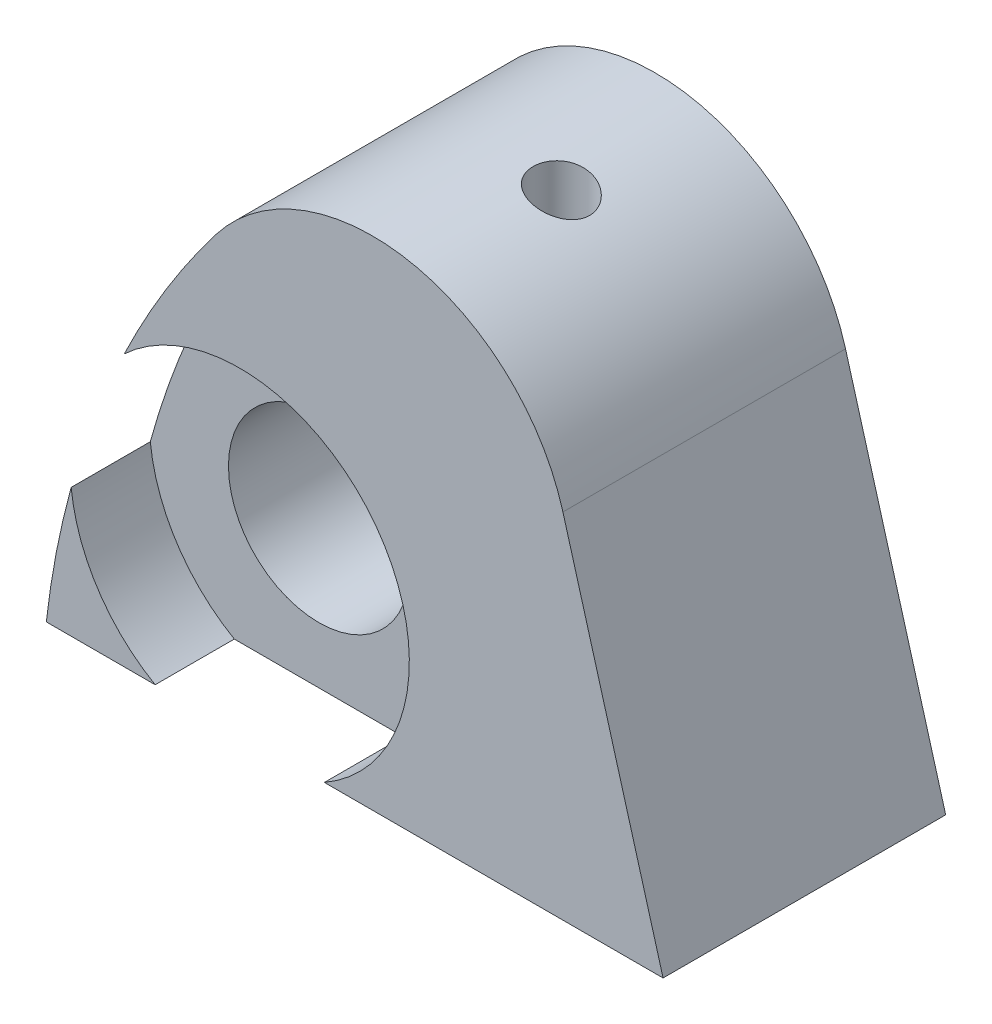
ISO-10303-21;
HEADER;
FILE_DESCRIPTION(('STEP AP214'),'2;1');
FILE_NAME('part.step','',(''),(''),'','','');
FILE_SCHEMA(('AUTOMOTIVE_DESIGN { 1 0 10303 214 1 1 1 1 }'));
ENDSEC;
DATA;
#1=APPLICATION_CONTEXT('core data for automotive mechanical design processes');
#2=APPLICATION_PROTOCOL_DEFINITION('international standard','automotive_design',2000,#1);
#3=PRODUCT_CONTEXT('',#1,'mechanical');
#4=PRODUCT('Part','Part','',(#3));
#5=PRODUCT_RELATED_PRODUCT_CATEGORY('part','',(#4));
#6=PRODUCT_DEFINITION_FORMATION('','',#4);
#7=PRODUCT_DEFINITION_CONTEXT('part definition',#1,'design');
#8=PRODUCT_DEFINITION('design','',#6,#7);
#9=PRODUCT_DEFINITION_SHAPE('','',#8);
#10=(LENGTH_UNIT() NAMED_UNIT(*) SI_UNIT(.MILLI.,.METRE.));
#11=(NAMED_UNIT(*) PLANE_ANGLE_UNIT() SI_UNIT($,.RADIAN.));
#12=(NAMED_UNIT(*) SI_UNIT($,.STERADIAN.) SOLID_ANGLE_UNIT());
#13=UNCERTAINTY_MEASURE_WITH_UNIT(LENGTH_MEASURE(1.E-05),#10,'distance_accuracy_value','');
#14=(GEOMETRIC_REPRESENTATION_CONTEXT(3) GLOBAL_UNCERTAINTY_ASSIGNED_CONTEXT((#13)) GLOBAL_UNIT_ASSIGNED_CONTEXT((#10,
#11,#12)) REPRESENTATION_CONTEXT('',''));
#15=CARTESIAN_POINT('',(0.,0.,0.));
#16=DIRECTION('',(0.,0.,1.));
#17=DIRECTION('',(1.,0.,0.));
#18=AXIS2_PLACEMENT_3D('',#15,#16,#17);
#19=CARTESIAN_POINT('',(0.839536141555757,3.5,2.5));
#20=DIRECTION('',(0.,-1.,0.));
#21=DIRECTION('',(1.,0.,0.));
#22=AXIS2_PLACEMENT_3D('',#19,#20,#21);
#23=CYLINDRICAL_SURFACE('',#22,0.5);
#24=CARTESIAN_POINT('',(1.33953614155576,3.23351866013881,2.5));
#25=CARTESIAN_POINT('',(1.33953481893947,3.2335194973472,2.52668078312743));
#26=CARTESIAN_POINT('',(1.33739077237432,3.23440999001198,2.55337834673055));
#27=CARTESIAN_POINT('',(1.32889966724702,3.23790762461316,2.60599641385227));
#28=CARTESIAN_POINT('',(1.32254813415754,3.24051659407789,2.63191605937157));
#29=CARTESIAN_POINT('',(1.30591617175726,3.24725462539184,2.68217754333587));
#30=CARTESIAN_POINT('',(1.29564519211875,3.251380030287,2.70652301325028));
#31=CARTESIAN_POINT('',(1.2715395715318,3.26088243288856,2.75310316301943));
#32=CARTESIAN_POINT('',(1.25770492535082,3.26625943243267,2.77533783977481));
#33=CARTESIAN_POINT('',(1.22629237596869,3.27818536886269,2.81803955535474));
#34=CARTESIAN_POINT('',(1.20858991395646,3.2847717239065,2.83840434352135));
#35=CARTESIAN_POINT('',(1.17028728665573,3.29861215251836,2.87592966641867));
#36=CARTESIAN_POINT('',(1.1496862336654,3.30586643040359,2.89308921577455));
#37=CARTESIAN_POINT('',(1.10465540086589,3.32119520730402,2.92487668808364));
#38=CARTESIAN_POINT('',(1.08006285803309,3.32929226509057,2.93926361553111));
#39=CARTESIAN_POINT('',(1.02879486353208,3.34549006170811,2.96366743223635));
#40=CARTESIAN_POINT('',(1.00211897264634,3.35359080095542,2.97368339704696));
#41=CARTESIAN_POINT('',(0.946588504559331,3.36969260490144,2.98927947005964));
#42=CARTESIAN_POINT('',(0.917693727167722,3.37768443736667,2.99472670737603));
#43=CARTESIAN_POINT('',(0.859227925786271,3.39302818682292,3.00047452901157));
#44=CARTESIAN_POINT('',(0.829656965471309,3.40038016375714,3.0007755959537));
#45=CARTESIAN_POINT('',(0.771246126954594,3.41409777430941,2.99616465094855));
#46=CARTESIAN_POINT('',(0.742402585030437,3.42047859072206,2.99134501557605));
#47=CARTESIAN_POINT('',(0.685815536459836,3.43227217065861,2.97667987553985));
#48=CARTESIAN_POINT('',(0.658071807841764,3.43768513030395,2.96683539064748));
#49=CARTESIAN_POINT('',(0.605517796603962,3.44732337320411,2.94276625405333));
#50=CARTESIAN_POINT('',(0.58063943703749,3.45158310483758,2.92870391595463));
#51=CARTESIAN_POINT('',(0.533548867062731,3.45917549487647,2.89646642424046));
#52=CARTESIAN_POINT('',(0.511336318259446,3.46250827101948,2.87829179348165));
#53=CARTESIAN_POINT('',(0.470751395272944,3.46825675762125,2.83879460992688));
#54=CARTESIAN_POINT('',(0.452304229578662,3.47069131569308,2.81755157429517));
#55=CARTESIAN_POINT('',(0.419204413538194,3.47484485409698,2.77222886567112));
#56=CARTESIAN_POINT('',(0.404551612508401,3.47656386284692,2.74814930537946));
#57=CARTESIAN_POINT('',(0.379564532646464,3.4793804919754,2.69800486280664));
#58=CARTESIAN_POINT('',(0.369203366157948,3.48048199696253,2.67195358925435));
#59=CARTESIAN_POINT('',(0.352971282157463,3.48216575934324,2.61847181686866));
#60=CARTESIAN_POINT('',(0.347100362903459,3.48274801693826,2.59104131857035));
#61=CARTESIAN_POINT('',(0.340019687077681,3.48344649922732,2.5355713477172));
#62=CARTESIAN_POINT('',(0.338811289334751,3.48356258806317,2.5075317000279));
#63=CARTESIAN_POINT('',(0.341094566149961,3.48333973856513,2.4516461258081));
#64=CARTESIAN_POINT('',(0.344586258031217,3.48300079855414,2.42380019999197));
#65=CARTESIAN_POINT('',(0.356170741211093,3.48183513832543,2.36907856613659));
#66=CARTESIAN_POINT('',(0.364265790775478,3.48100817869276,2.34220334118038));
#67=CARTESIAN_POINT('',(0.384820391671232,3.4787956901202,2.29020197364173));
#68=CARTESIAN_POINT('',(0.397279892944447,3.47741016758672,2.26507581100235));
#69=CARTESIAN_POINT('',(0.426182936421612,3.47398602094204,2.21730225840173));
#70=CARTESIAN_POINT('',(0.442623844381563,3.47194782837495,2.19465324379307));
#71=CARTESIAN_POINT('',(0.478998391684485,3.46711640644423,2.15245363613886));
#72=CARTESIAN_POINT('',(0.498931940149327,3.46432319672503,2.13290296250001));
#73=CARTESIAN_POINT('',(0.54168986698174,3.45789510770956,2.09743413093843));
#74=CARTESIAN_POINT('',(0.564514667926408,3.45426010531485,2.08151650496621));
#75=CARTESIAN_POINT('',(0.612361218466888,3.44609953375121,2.05372990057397));
#76=CARTESIAN_POINT('',(0.637382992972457,3.441573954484,2.04186096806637));
#77=CARTESIAN_POINT('',(0.68909172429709,3.43159597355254,2.02236394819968));
#78=CARTESIAN_POINT('',(0.715790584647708,3.42613632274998,2.01477119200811));
#79=CARTESIAN_POINT('',(0.76989666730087,3.41438510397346,2.00410586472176));
#80=CARTESIAN_POINT('',(0.797303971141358,3.40809343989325,2.00103381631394));
#81=CARTESIAN_POINT('',(0.852740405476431,3.39465262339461,1.99938736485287));
#82=CARTESIAN_POINT('',(0.880768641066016,3.3874864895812,2.00092288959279));
#83=CARTESIAN_POINT('',(0.936042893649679,3.37263154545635,2.00860858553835));
#84=CARTESIAN_POINT('',(0.963288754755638,3.36494263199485,2.01475966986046));
#85=CARTESIAN_POINT('',(1.01721981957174,3.34904177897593,2.03175354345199));
#86=CARTESIAN_POINT('',(1.04385440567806,3.3408209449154,2.04274884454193));
#87=CARTESIAN_POINT('',(1.09486863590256,3.32445202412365,2.06915139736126));
#88=CARTESIAN_POINT('',(1.11924788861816,3.31630395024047,2.0845594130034));
#89=CARTESIAN_POINT('',(1.16547483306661,3.30034491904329,2.11970962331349));
#90=CARTESIAN_POINT('',(1.18727438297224,3.29254169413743,2.13951883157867));
#91=CARTESIAN_POINT('',(1.22720378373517,3.27786888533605,2.18285429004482));
#92=CARTESIAN_POINT('',(1.24533332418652,3.27099938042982,2.20638085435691));
#93=CARTESIAN_POINT('',(1.27676926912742,3.25885503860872,2.25575230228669));
#94=CARTESIAN_POINT('',(1.29020890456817,3.25353700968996,2.28150154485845));
#95=CARTESIAN_POINT('',(1.31247665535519,3.24461871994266,2.33517284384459));
#96=CARTESIAN_POINT('',(1.32131275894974,3.24101548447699,2.36309103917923));
#97=CARTESIAN_POINT('',(1.33158932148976,3.23680194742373,2.40936421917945));
#98=CARTESIAN_POINT('',(1.33456326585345,3.23557498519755,2.42733738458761));
#99=CARTESIAN_POINT('',(1.33853706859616,3.23393307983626,2.46353776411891));
#100=CARTESIAN_POINT('',(1.33953704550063,3.233518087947,2.48176496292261));
#101=CARTESIAN_POINT('',(1.33953614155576,3.23351866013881,2.5));
#102=B_SPLINE_CURVE_WITH_KNOTS('',3,(#24,#25,#26,#27,#28,#29,#30,#31,#32,#33,#34,#35,#36,#37,
#38,#39,#40,#41,#42,#43,#44,#45,#46,#47,#48,#49,#50,#51,#52,#53,#54,#55,#56,#57,#58,#59,#60,#61,
#62,#63,#64,#65,#66,#67,#68,#69,#70,#71,#72,#73,#74,#75,#76,#77,#78,#79,#80,#81,#82,#83,#84,#85,
#86,#87,#88,#89,#90,#91,#92,#93,#94,#95,#96,#97,#98,#99,#100,#101),.UNSPECIFIED.,.T.,.F.,(4,2,2,
2,2,2,2,2,2,2,2,2,2,2,2,2,2,2,2,2,2,2,2,2,2,2,2,2,2,2,2,2,2,2,2,2,2,2,4),(0.,0.0799726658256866,
0.160030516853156,0.239896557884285,0.319762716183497,0.402732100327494,0.485726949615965,
0.57418493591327,0.662661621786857,0.753630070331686,0.844589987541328,0.933936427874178,
1.02326474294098,1.10952040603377,1.19576510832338,1.28008044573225,1.3643924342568,
1.4481679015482,1.53194333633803,1.61574318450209,1.69954334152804,1.78338464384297,
1.86722498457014,1.95101000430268,2.03479284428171,2.11858794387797,2.20238399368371,
2.28686260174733,2.3713509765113,2.45787097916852,2.54440810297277,2.63388960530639,
2.72338660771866,2.81435316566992,2.9053274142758,2.9934534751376,3.08142610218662,
3.1360868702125,3.19074435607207),.UNSPECIFIED.);
#103=CARTESIAN_POINT('',(1.33953614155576,3.23351866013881,2.5));
#104=VERTEX_POINT('',#103);
#105=EDGE_CURVE('E151',#104,#104,#102,.T.);
#106=ORIENTED_EDGE('',*,*,#105,.F.);
#107=EDGE_LOOP('',(#106));
#108=FACE_BOUND('',#107,.T.);
#109=CARTESIAN_POINT('',(0.839536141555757,-0.300000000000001,2.5));
#110=DIRECTION('',(0.,-1.,0.));
#111=DIRECTION('',(1.,0.,0.));
#112=AXIS2_PLACEMENT_3D('',#109,#110,#111);
#113=CIRCLE('',#112,0.5);
#114=CARTESIAN_POINT('',(1.33953614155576,-0.300000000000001,2.5));
#115=VERTEX_POINT('',#114);
#116=EDGE_CURVE('E149',#115,#115,#113,.F.);
#117=ORIENTED_EDGE('',*,*,#116,.F.);
#118=EDGE_LOOP('',(#117));
#119=FACE_BOUND('',#118,.T.);
#120=ADVANCED_FACE('F38',(#108,#119),#23,.F.);
#121=CARTESIAN_POINT('',(9.13180705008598,-6.99,5.));
#122=DIRECTION('',(0.,0.,1.));
#123=DIRECTION('',(1.,0.,0.));
#124=AXIS2_PLACEMENT_3D('',#121,#122,#123);
#125=PLANE('',#124);
#126=CARTESIAN_POINT('',(-2.35,-2.7,5.));
#127=DIRECTION('',(0.,0.,1.));
#128=DIRECTION('',(1.,0.,0.));
#129=AXIS2_PLACEMENT_3D('',#126,#127,#128);
#130=CIRCLE('',#129,3.);
#131=CARTESIAN_POINT('',(-5.33299896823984,-3.01893127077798,5.));
#132=VERTEX_POINT('',#131);
#133=CARTESIAN_POINT('',(-3.84666295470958,-5.3,5.));
#134=VERTEX_POINT('',#133);
#135=EDGE_CURVE('E108',#132,#134,#130,.T.);
#136=ORIENTED_EDGE('',*,*,#135,.F.);
#137=CARTESIAN_POINT('',(9.13180705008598,-6.99,5.));
#138=DIRECTION('',(0.,0.,1.));
#139=DIRECTION('',(1.,0.,0.));
#140=AXIS2_PLACEMENT_3D('',#137,#138,#139);
#141=CIRCLE('',#140,15.);
#142=CARTESIAN_POINT('',(-5.77268556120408,-5.3,5.));
#143=VERTEX_POINT('',#142);
#144=EDGE_CURVE('E125',#132,#143,#141,.T.);
#145=ORIENTED_EDGE('',*,*,#144,.T.);
#146=DIRECTION('',(1.,0.,0.));
#147=VECTOR('',#146,1.);
#148=CARTESIAN_POINT('',(-5.77268556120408,-5.3,5.));
#149=LINE('',#148,#147);
#150=EDGE_CURVE('E127',#143,#134,#149,.T.);
#151=ORIENTED_EDGE('',*,*,#150,.T.);
#152=EDGE_LOOP('',(#136,#145,#151));
#153=FACE_BOUND('',#152,.T.);
#154=ADVANCED_FACE('F171',(#153),#125,.T.);
#155=CARTESIAN_POINT('',(-2.35,-2.7,0.));
#156=DIRECTION('',(0.,0.,1.));
#157=DIRECTION('',(1.,0.,0.));
#158=AXIS2_PLACEMENT_3D('',#155,#156,#157);
#159=CYLINDRICAL_SURFACE('',#158,1.6);
#160=CARTESIAN_POINT('',(-2.35,-2.7,0.));
#161=DIRECTION('',(0.,0.,1.));
#162=DIRECTION('',(1.,0.,0.));
#163=AXIS2_PLACEMENT_3D('',#160,#161,#162);
#164=CIRCLE('',#163,1.6);
#165=CARTESIAN_POINT('',(-0.75,-2.7,0.));
#166=VERTEX_POINT('',#165);
#167=EDGE_CURVE('E119',#166,#166,#164,.T.);
#168=ORIENTED_EDGE('',*,*,#167,.F.);
#169=EDGE_LOOP('',(#168));
#170=FACE_BOUND('',#169,.T.);
#171=CARTESIAN_POINT('',(-2.35,-2.7,3.6));
#172=DIRECTION('',(0.,0.,1.));
#173=DIRECTION('',(1.,0.,0.));
#174=AXIS2_PLACEMENT_3D('',#171,#172,#173);
#175=CIRCLE('',#174,1.6);
#176=CARTESIAN_POINT('',(-0.75,-2.7,3.6));
#177=VERTEX_POINT('',#176);
#178=EDGE_CURVE('E144',#177,#177,#175,.F.);
#179=ORIENTED_EDGE('',*,*,#178,.F.);
#180=EDGE_LOOP('',(#179));
#181=FACE_BOUND('',#180,.T.);
#182=ADVANCED_FACE('F179',(#170,#181),#159,.F.);
#183=CARTESIAN_POINT('',(3.36743011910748,0.954156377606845,5.));
#184=DIRECTION('',(-0.962122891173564,-0.27261610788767,0.));
#185=DIRECTION('',(0.27261610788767,-0.962122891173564,0.));
#186=AXIS2_PLACEMENT_3D('',#183,#184,#185);
#187=PLANE('',#186);
#188=DIRECTION('',(-0.27261610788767,0.962122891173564,0.));
#189=VECTOR('',#188,1.);
#190=CARTESIAN_POINT('',(3.36743011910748,0.954156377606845,0.));
#191=LINE('',#190,#189);
#192=CARTESIAN_POINT('',(5.13953614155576,-5.3,0.));
#193=VERTEX_POINT('',#192);
#194=CARTESIAN_POINT('',(3.36743011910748,0.954156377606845,0.));
#195=VERTEX_POINT('',#194);
#196=EDGE_CURVE('E244',#193,#195,#191,.T.);
#197=ORIENTED_EDGE('',*,*,#196,.T.);
#198=DIRECTION('',(0.,0.,-1.));
#199=VECTOR('',#198,1.);
#200=CARTESIAN_POINT('',(3.36743011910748,0.954156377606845,5.));
#201=LINE('',#200,#199);
#202=CARTESIAN_POINT('',(3.36743011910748,0.954156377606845,5.));
#203=VERTEX_POINT('',#202);
#204=EDGE_CURVE('E141',#203,#195,#201,.T.);
#205=ORIENTED_EDGE('',*,*,#204,.F.);
#206=DIRECTION('',(-0.27261610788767,0.962122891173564,0.));
#207=VECTOR('',#206,1.);
#208=CARTESIAN_POINT('',(3.36743011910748,0.954156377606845,5.));
#209=LINE('',#208,#207);
#210=CARTESIAN_POINT('',(5.13953614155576,-5.3,5.));
#211=VERTEX_POINT('',#210);
#212=EDGE_CURVE('E252',#211,#203,#209,.T.);
#213=ORIENTED_EDGE('',*,*,#212,.F.);
#214=DIRECTION('',(0.,0.,-1.));
#215=VECTOR('',#214,1.);
#216=CARTESIAN_POINT('',(5.13953614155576,-5.3,5.));
#217=LINE('',#216,#215);
#218=EDGE_CURVE('E133',#211,#193,#217,.T.);
#219=ORIENTED_EDGE('',*,*,#218,.T.);
#220=EDGE_LOOP('',(#197,#205,#213,#219));
#221=FACE_BOUND('',#220,.T.);
#222=ADVANCED_FACE('F40',(#221),#187,.F.);
#223=CARTESIAN_POINT('',(0.,0.,5.));
#224=DIRECTION('',(0.,0.,-1.));
#225=DIRECTION('',(-1.,0.,0.));
#226=AXIS2_PLACEMENT_3D('',#223,#224,#225);
#227=CYLINDRICAL_SURFACE('',#226,3.5);
#228=ORIENTED_EDGE('',*,*,#105,.T.);
#229=EDGE_LOOP('',(#228));
#230=FACE_BOUND('',#229,.T.);
#231=CARTESIAN_POINT('',(0.,0.,0.));
#232=DIRECTION('',(0.,0.,1.));
#233=DIRECTION('',(1.,0.,0.));
#234=AXIS2_PLACEMENT_3D('',#231,#232,#233);
#235=CIRCLE('',#234,3.5);
#236=CARTESIAN_POINT('',(-2.77924562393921,2.12739130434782,0.));
#237=VERTEX_POINT('',#236);
#238=EDGE_CURVE('E247',#195,#237,#235,.T.);
#239=ORIENTED_EDGE('',*,*,#238,.T.);
#240=DIRECTION('',(0.,0.,-1.));
#241=VECTOR('',#240,1.);
#242=CARTESIAN_POINT('',(-2.77924562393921,2.12739130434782,5.));
#243=LINE('',#242,#241);
#244=CARTESIAN_POINT('',(-2.77924562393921,2.12739130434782,5.));
#245=VERTEX_POINT('',#244);
#246=EDGE_CURVE('E139',#245,#237,#243,.T.);
#247=ORIENTED_EDGE('',*,*,#246,.F.);
#248=CARTESIAN_POINT('',(0.,0.,5.));
#249=DIRECTION('',(0.,0.,1.));
#250=DIRECTION('',(1.,0.,0.));
#251=AXIS2_PLACEMENT_3D('',#248,#249,#250);
#252=CIRCLE('',#251,3.5);
#253=EDGE_CURVE('E123',#203,#245,#252,.T.);
#254=ORIENTED_EDGE('',*,*,#253,.F.);
#255=ORIENTED_EDGE('',*,*,#204,.T.);
#256=EDGE_LOOP('',(#239,#247,#254,#255));
#257=FACE_BOUND('',#256,.T.);
#258=ADVANCED_FACE('F196',(#230,#257),#227,.T.);
#259=CARTESIAN_POINT('',(9.13180705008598,-6.99,5.));
#260=DIRECTION('',(0.,0.,-1.));
#261=DIRECTION('',(-1.,0.,0.));
#262=AXIS2_PLACEMENT_3D('',#259,#260,#261);
#263=CYLINDRICAL_SURFACE('',#262,15.);
#264=CARTESIAN_POINT('',(9.13180705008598,-6.99,3.6));
#265=DIRECTION('',(0.,0.,1.));
#266=DIRECTION('',(1.,0.,0.));
#267=AXIS2_PLACEMENT_3D('',#264,#265,#266);
#268=CIRCLE('',#267,15.);
#269=CARTESIAN_POINT('',(-4.39302456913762,-0.503172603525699,3.6));
#270=VERTEX_POINT('',#269);
#271=CARTESIAN_POINT('',(-5.33299896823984,-3.01893127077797,3.6));
#272=VERTEX_POINT('',#271);
#273=EDGE_CURVE('E118',#270,#272,#268,.T.);
#274=ORIENTED_EDGE('',*,*,#273,.F.);
#275=DIRECTION('',(0.,0.,1.));
#276=VECTOR('',#275,1.);
#277=CARTESIAN_POINT('',(-4.39302456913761,-0.503172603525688,4.3));
#278=LINE('',#277,#276);
#279=CARTESIAN_POINT('',(-4.39302456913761,-0.503172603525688,5.));
#280=VERTEX_POINT('',#279);
#281=EDGE_CURVE('E105',#270,#280,#278,.T.);
#282=ORIENTED_EDGE('',*,*,#281,.T.);
#283=EDGE_CURVE('E116',#245,#280,#141,.T.);
#284=ORIENTED_EDGE('',*,*,#283,.F.);
#285=ORIENTED_EDGE('',*,*,#246,.T.);
#286=CARTESIAN_POINT('',(9.13180705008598,-6.99,0.));
#287=DIRECTION('',(0.,0.,1.));
#288=DIRECTION('',(1.,0.,0.));
#289=AXIS2_PLACEMENT_3D('',#286,#287,#288);
#290=CIRCLE('',#289,15.);
#291=CARTESIAN_POINT('',(-5.77268556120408,-5.3,0.));
#292=VERTEX_POINT('',#291);
#293=EDGE_CURVE('E249',#237,#292,#290,.T.);
#294=ORIENTED_EDGE('',*,*,#293,.T.);
#295=DIRECTION('',(0.,0.,-1.));
#296=VECTOR('',#295,1.);
#297=CARTESIAN_POINT('',(-5.77268556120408,-5.3,5.));
#298=LINE('',#297,#296);
#299=EDGE_CURVE('E136',#143,#292,#298,.T.);
#300=ORIENTED_EDGE('',*,*,#299,.F.);
#301=ORIENTED_EDGE('',*,*,#144,.F.);
#302=DIRECTION('',(0.,0.,1.));
#303=VECTOR('',#302,1.);
#304=CARTESIAN_POINT('',(-5.33299896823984,-3.01893127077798,4.3));
#305=LINE('',#304,#303);
#306=EDGE_CURVE('E120',#132,#272,#305,.F.);
#307=ORIENTED_EDGE('',*,*,#306,.T.);
#308=EDGE_LOOP('',(#274,#282,#284,#285,#294,#300,#301,#307));
#309=FACE_BOUND('',#308,.T.);
#310=ADVANCED_FACE('F114',(#309),#263,.T.);
#311=CARTESIAN_POINT('',(-5.77268556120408,-5.3,5.));
#312=DIRECTION('',(0.,1.,0.));
#313=DIRECTION('',(-1.,0.,0.));
#314=AXIS2_PLACEMENT_3D('',#311,#312,#313);
#315=PLANE('',#314);
#316=CARTESIAN_POINT('',(0.839536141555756,-5.3,2.5));
#317=DIRECTION('',(0.,1.,0.));
#318=DIRECTION('',(-1.,0.,0.));
#319=AXIS2_PLACEMENT_3D('',#316,#317,#318);
#320=CIRCLE('',#319,1.5);
#321=CARTESIAN_POINT('',(-0.660463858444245,-5.3,2.5));
#322=VERTEX_POINT('',#321);
#323=EDGE_CURVE('E13',#322,#322,#320,.T.);
#324=ORIENTED_EDGE('',*,*,#323,.T.);
#325=EDGE_LOOP('',(#324));
#326=FACE_BOUND('',#325,.T.);
#327=DIRECTION('',(1.,0.,0.));
#328=VECTOR('',#327,1.);
#329=CARTESIAN_POINT('',(-5.77268556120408,-5.3,3.6));
#330=LINE('',#329,#328);
#331=CARTESIAN_POINT('',(-3.84666295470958,-5.3,3.6));
#332=VERTEX_POINT('',#331);
#333=CARTESIAN_POINT('',(-0.853337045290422,-5.3,3.6));
#334=VERTEX_POINT('',#333);
#335=EDGE_CURVE('E147',#332,#334,#330,.T.);
#336=ORIENTED_EDGE('',*,*,#335,.F.);
#337=DIRECTION('',(0.,0.,1.));
#338=VECTOR('',#337,1.);
#339=CARTESIAN_POINT('',(-3.84666295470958,-5.3,3.6));
#340=LINE('',#339,#338);
#341=EDGE_CURVE('E238',#332,#134,#340,.T.);
#342=ORIENTED_EDGE('',*,*,#341,.T.);
#343=ORIENTED_EDGE('',*,*,#150,.F.);
#344=ORIENTED_EDGE('',*,*,#299,.T.);
#345=DIRECTION('',(1.,0.,0.));
#346=VECTOR('',#345,1.);
#347=CARTESIAN_POINT('',(-5.77268556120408,-5.3,0.));
#348=LINE('',#347,#346);
#349=EDGE_CURVE('E251',#292,#193,#348,.T.);
#350=ORIENTED_EDGE('',*,*,#349,.T.);
#351=ORIENTED_EDGE('',*,*,#218,.F.);
#352=CARTESIAN_POINT('',(-0.853337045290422,-5.3,5.));
#353=VERTEX_POINT('',#352);
#354=EDGE_CURVE('E60',#353,#211,#149,.T.);
#355=ORIENTED_EDGE('',*,*,#354,.F.);
#356=DIRECTION('',(0.,0.,1.));
#357=VECTOR('',#356,1.);
#358=CARTESIAN_POINT('',(-0.853337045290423,-5.3,3.6));
#359=LINE('',#358,#357);
#360=EDGE_CURVE('E53',#353,#334,#359,.F.);
#361=ORIENTED_EDGE('',*,*,#360,.T.);
#362=EDGE_LOOP('',(#336,#342,#343,#344,#350,#351,#355,#361));
#363=FACE_BOUND('',#362,.T.);
#364=ADVANCED_FACE('F202',(#326,#363),#315,.F.);
#365=EDGE_CURVE('E102',#353,#280,#130,.T.);
#366=ORIENTED_EDGE('',*,*,#365,.F.);
#367=ORIENTED_EDGE('',*,*,#354,.T.);
#368=ORIENTED_EDGE('',*,*,#212,.T.);
#369=ORIENTED_EDGE('',*,*,#253,.T.);
#370=ORIENTED_EDGE('',*,*,#283,.T.);
#371=EDGE_LOOP('',(#366,#367,#368,#369,#370));
#372=FACE_BOUND('',#371,.T.);
#373=ADVANCED_FACE('F122',(#372),#125,.T.);
#374=CARTESIAN_POINT('',(9.13180705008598,-6.99,0.));
#375=DIRECTION('',(0.,0.,1.));
#376=DIRECTION('',(1.,0.,0.));
#377=AXIS2_PLACEMENT_3D('',#374,#375,#376);
#378=PLANE('',#377);
#379=CARTESIAN_POINT('',(0.,0.,0.));
#380=DIRECTION('',(0.,0.,-1.));
#381=DIRECTION('',(-1.,0.,0.));
#382=AXIS2_PLACEMENT_3D('',#379,#380,#381);
#383=CIRCLE('',#382,1.);
#384=CARTESIAN_POINT('',(-1.,0.,0.));
#385=VERTEX_POINT('',#384);
#386=EDGE_CURVE('E194',#385,#385,#383,.T.);
#387=ORIENTED_EDGE('',*,*,#386,.F.);
#388=EDGE_LOOP('',(#387));
#389=FACE_BOUND('',#388,.T.);
#390=ORIENTED_EDGE('',*,*,#167,.T.);
#391=EDGE_LOOP('',(#390));
#392=FACE_BOUND('',#391,.T.);
#393=ORIENTED_EDGE('',*,*,#196,.F.);
#394=ORIENTED_EDGE('',*,*,#349,.F.);
#395=ORIENTED_EDGE('',*,*,#293,.F.);
#396=ORIENTED_EDGE('',*,*,#238,.F.);
#397=EDGE_LOOP('',(#393,#394,#395,#396));
#398=FACE_BOUND('',#397,.T.);
#399=ADVANCED_FACE('F207',(#389,#392,#398),#378,.F.);
#400=CARTESIAN_POINT('',(-2.35,-2.7,3.6));
#401=DIRECTION('',(0.,0.,1.));
#402=DIRECTION('',(1.,0.,0.));
#403=AXIS2_PLACEMENT_3D('',#400,#401,#402);
#404=CYLINDRICAL_SURFACE('',#403,3.);
#405=CARTESIAN_POINT('',(-2.35,-2.7,3.6));
#406=DIRECTION('',(0.,0.,1.));
#407=DIRECTION('',(1.,0.,0.));
#408=AXIS2_PLACEMENT_3D('',#405,#406,#407);
#409=CIRCLE('',#408,3.);
#410=EDGE_CURVE('E233',#334,#270,#409,.T.);
#411=ORIENTED_EDGE('',*,*,#410,.F.);
#412=ORIENTED_EDGE('',*,*,#360,.F.);
#413=ORIENTED_EDGE('',*,*,#365,.T.);
#414=ORIENTED_EDGE('',*,*,#281,.F.);
#415=EDGE_LOOP('',(#411,#412,#413,#414));
#416=FACE_BOUND('',#415,.T.);
#417=ADVANCED_FACE('F104',(#416),#404,.F.);
#418=ORIENTED_EDGE('',*,*,#135,.T.);
#419=ORIENTED_EDGE('',*,*,#341,.F.);
#420=EDGE_CURVE('E148',#272,#332,#409,.T.);
#421=ORIENTED_EDGE('',*,*,#420,.F.);
#422=ORIENTED_EDGE('',*,*,#306,.F.);
#423=EDGE_LOOP('',(#418,#419,#421,#422));
#424=FACE_BOUND('',#423,.T.);
#425=ADVANCED_FACE('F216',(#424),#404,.F.);
#426=CARTESIAN_POINT('',(-2.35,-2.7,3.6));
#427=DIRECTION('',(0.,0.,1.));
#428=DIRECTION('',(1.,0.,0.));
#429=AXIS2_PLACEMENT_3D('',#426,#427,#428);
#430=PLANE('',#429);
#431=ORIENTED_EDGE('',*,*,#178,.T.);
#432=EDGE_LOOP('',(#431));
#433=FACE_BOUND('',#432,.T.);
#434=ORIENTED_EDGE('',*,*,#273,.T.);
#435=ORIENTED_EDGE('',*,*,#420,.T.);
#436=ORIENTED_EDGE('',*,*,#335,.T.);
#437=ORIENTED_EDGE('',*,*,#410,.T.);
#438=EDGE_LOOP('',(#434,#435,#436,#437));
#439=FACE_BOUND('',#438,.T.);
#440=ADVANCED_FACE('F217',(#433,#439),#430,.T.);
#441=CARTESIAN_POINT('',(0.,0.,1.3));
#442=DIRECTION('',(0.,0.,-1.));
#443=DIRECTION('',(-1.,0.,0.));
#444=AXIS2_PLACEMENT_3D('',#441,#442,#443);
#445=CYLINDRICAL_SURFACE('',#444,1.);
#446=CARTESIAN_POINT('',(0.,0.,1.3));
#447=DIRECTION('',(0.,0.,-1.));
#448=DIRECTION('',(-1.,0.,0.));
#449=AXIS2_PLACEMENT_3D('',#446,#447,#448);
#450=CIRCLE('',#449,1.);
#451=CARTESIAN_POINT('',(-1.,0.,1.3));
#452=VERTEX_POINT('',#451);
#453=EDGE_CURVE('E109',#452,#452,#450,.T.);
#454=ORIENTED_EDGE('',*,*,#453,.F.);
#455=EDGE_LOOP('',(#454));
#456=FACE_BOUND('',#455,.T.);
#457=ORIENTED_EDGE('',*,*,#386,.T.);
#458=EDGE_LOOP('',(#457));
#459=FACE_BOUND('',#458,.T.);
#460=ADVANCED_FACE('F219',(#456,#459),#445,.F.);
#461=CARTESIAN_POINT('',(0.,0.,1.3));
#462=DIRECTION('',(0.,0.,-1.));
#463=DIRECTION('',(-1.,0.,0.));
#464=AXIS2_PLACEMENT_3D('',#461,#462,#463);
#465=PLANE('',#464);
#466=ORIENTED_EDGE('',*,*,#453,.T.);
#467=EDGE_LOOP('',(#466));
#468=FACE_BOUND('',#467,.T.);
#469=ADVANCED_FACE('F186',(#468),#465,.T.);
#470=CARTESIAN_POINT('',(0.839536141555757,-0.300000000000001,2.5));
#471=DIRECTION('',(0.,-1.,0.));
#472=DIRECTION('',(1.,0.,0.));
#473=AXIS2_PLACEMENT_3D('',#470,#471,#472);
#474=PLANE('',#473);
#475=CARTESIAN_POINT('',(0.839536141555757,-0.300000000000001,2.5));
#476=DIRECTION('',(0.,-1.,0.));
#477=DIRECTION('',(1.,0.,0.));
#478=AXIS2_PLACEMENT_3D('',#475,#476,#477);
#479=CIRCLE('',#478,1.);
#480=CARTESIAN_POINT('',(1.83953614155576,-0.300000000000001,2.5));
#481=VERTEX_POINT('',#480);
#482=EDGE_CURVE('E152',#481,#481,#479,.T.);
#483=ORIENTED_EDGE('',*,*,#482,.T.);
#484=EDGE_LOOP('',(#483));
#485=FACE_BOUND('',#484,.T.);
#486=ORIENTED_EDGE('',*,*,#116,.T.);
#487=EDGE_LOOP('',(#486));
#488=FACE_BOUND('',#487,.T.);
#489=ADVANCED_FACE('F166',(#485,#488),#474,.T.);
#490=CARTESIAN_POINT('',(0.839536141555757,-0.300000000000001,2.5));
#491=DIRECTION('',(0.,-1.,0.));
#492=DIRECTION('',(1.,0.,0.));
#493=AXIS2_PLACEMENT_3D('',#490,#491,#492);
#494=CYLINDRICAL_SURFACE('',#493,1.);
#495=CARTESIAN_POINT('',(0.839536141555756,-4.8,2.5));
#496=DIRECTION('',(0.,1.,0.));
#497=DIRECTION('',(-1.,0.,0.));
#498=AXIS2_PLACEMENT_3D('',#495,#496,#497);
#499=CIRCLE('',#498,1.);
#500=CARTESIAN_POINT('',(-0.160463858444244,-4.8,2.5));
#501=VERTEX_POINT('',#500);
#502=EDGE_CURVE('E46',#501,#501,#499,.F.);
#503=ORIENTED_EDGE('',*,*,#502,.T.);
#504=EDGE_LOOP('',(#503));
#505=FACE_BOUND('',#504,.T.);
#506=ORIENTED_EDGE('',*,*,#482,.F.);
#507=EDGE_LOOP('',(#506));
#508=FACE_BOUND('',#507,.T.);
#509=ADVANCED_FACE('F156',(#505,#508),#494,.F.);
#510=CARTESIAN_POINT('',(0.839536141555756,-4.8,2.5));
#511=DIRECTION('',(0.,-1.,0.));
#512=DIRECTION('',(1.,0.,0.));
#513=AXIS2_PLACEMENT_3D('',#510,#511,#512);
#514=CONICAL_SURFACE('',#513,1.,0.78539816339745);
#515=ORIENTED_EDGE('',*,*,#323,.F.);
#516=EDGE_LOOP('',(#515));
#517=FACE_BOUND('',#516,.T.);
#518=ORIENTED_EDGE('',*,*,#502,.F.);
#519=EDGE_LOOP('',(#518));
#520=FACE_BOUND('',#519,.T.);
#521=ADVANCED_FACE('F159',(#517,#520),#514,.F.);
#522=CLOSED_SHELL('',(#120,#154,#182,#222,#258,#310,#364,#373,#399,#417,#425,#440,#460,#469,
#489,#509,#521));
#523=MANIFOLD_SOLID_BREP('B2',#522);
#524=ADVANCED_BREP_SHAPE_REPRESENTATION('',(#18,#523),#14);
#525=SHAPE_DEFINITION_REPRESENTATION(#9,#524);
ENDSEC;
END-ISO-10303-21;
